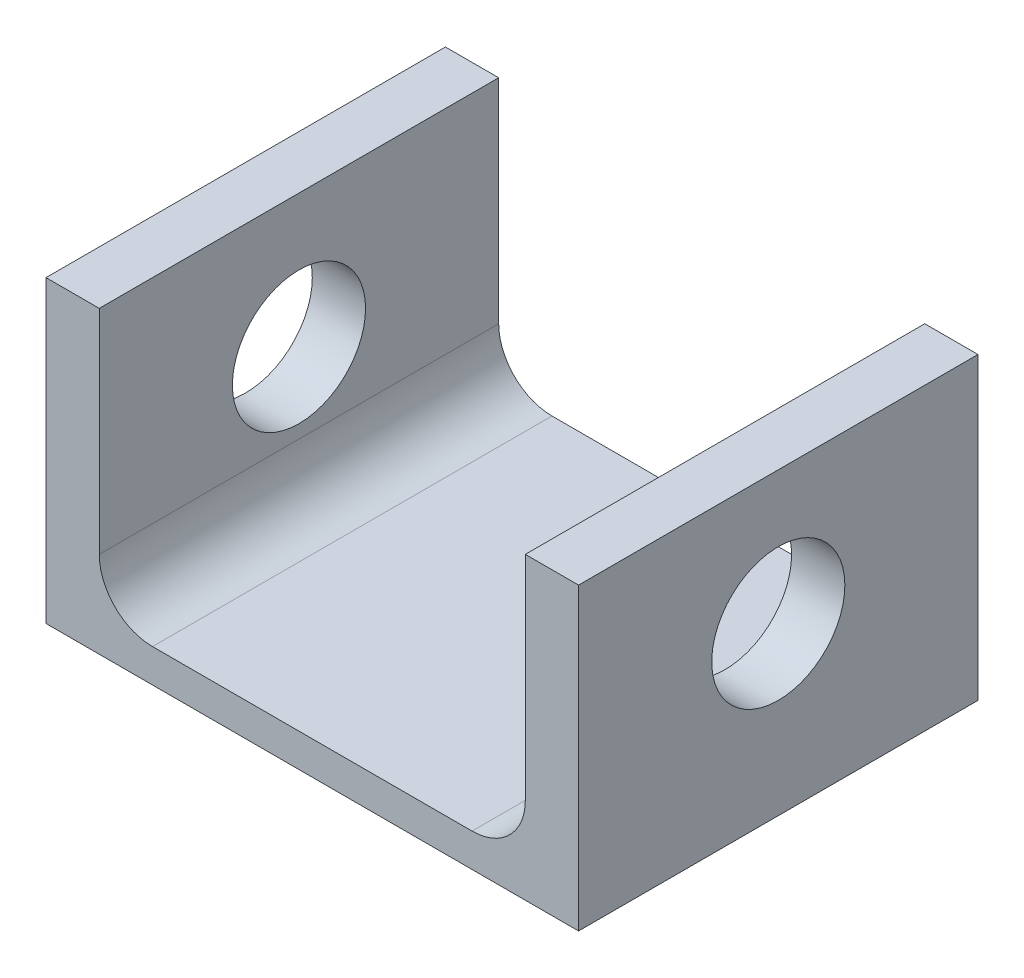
ISO-10303-21;
HEADER;
FILE_DESCRIPTION(('STEP AP214'),'2;1');
FILE_NAME('part.step','',(''),(''),'','','');
FILE_SCHEMA(('AUTOMOTIVE_DESIGN { 1 0 10303 214 1 1 1 1 }'));
ENDSEC;
DATA;
#1=APPLICATION_CONTEXT('core data for automotive mechanical design processes');
#2=APPLICATION_PROTOCOL_DEFINITION('international standard','automotive_design',2000,#1);
#3=PRODUCT_CONTEXT('',#1,'mechanical');
#4=PRODUCT('Part','Part','',(#3));
#5=PRODUCT_RELATED_PRODUCT_CATEGORY('part','',(#4));
#6=PRODUCT_DEFINITION_FORMATION('','',#4);
#7=PRODUCT_DEFINITION_CONTEXT('part definition',#1,'design');
#8=PRODUCT_DEFINITION('design','',#6,#7);
#9=PRODUCT_DEFINITION_SHAPE('','',#8);
#10=(LENGTH_UNIT() NAMED_UNIT(*) SI_UNIT(.MILLI.,.METRE.));
#11=(NAMED_UNIT(*) PLANE_ANGLE_UNIT() SI_UNIT($,.RADIAN.));
#12=(NAMED_UNIT(*) SI_UNIT($,.STERADIAN.) SOLID_ANGLE_UNIT());
#13=UNCERTAINTY_MEASURE_WITH_UNIT(LENGTH_MEASURE(1.E-05),#10,'distance_accuracy_value','');
#14=(GEOMETRIC_REPRESENTATION_CONTEXT(3) GLOBAL_UNCERTAINTY_ASSIGNED_CONTEXT((#13)) GLOBAL_UNIT_ASSIGNED_CONTEXT((#10,
#11,#12)) REPRESENTATION_CONTEXT('',''));
#15=CARTESIAN_POINT('',(0.,0.,0.));
#16=DIRECTION('',(0.,0.,1.));
#17=DIRECTION('',(1.,0.,0.));
#18=AXIS2_PLACEMENT_3D('',#15,#16,#17);
#19=CARTESIAN_POINT('',(-40.,45.,30.));
#20=DIRECTION('',(1.,0.,0.));
#21=DIRECTION('',(0.,0.,-1.));
#22=AXIS2_PLACEMENT_3D('',#19,#20,#21);
#23=PLANE('',#22);
#24=CARTESIAN_POINT('',(-40.,25.,0.));
#25=DIRECTION('',(1.,0.,0.));
#26=DIRECTION('',(0.,0.,-1.));
#27=AXIS2_PLACEMENT_3D('',#24,#25,#26);
#28=CIRCLE('',#27,10.);
#29=CARTESIAN_POINT('',(-40.,25.,-10.));
#30=VERTEX_POINT('',#29);
#31=EDGE_CURVE('E222',#30,#30,#28,.T.);
#32=ORIENTED_EDGE('',*,*,#31,.T.);
#33=EDGE_LOOP('',(#32));
#34=FACE_BOUND('',#33,.T.);
#35=DIRECTION('',(0.,-1.,0.));
#36=VECTOR('',#35,1.);
#37=CARTESIAN_POINT('',(-40.,45.,-30.));
#38=LINE('',#37,#36);
#39=CARTESIAN_POINT('',(-40.,45.,-30.));
#40=VERTEX_POINT('',#39);
#41=CARTESIAN_POINT('',(-40.,0.,-30.));
#42=VERTEX_POINT('',#41);
#43=EDGE_CURVE('E112',#40,#42,#38,.T.);
#44=ORIENTED_EDGE('',*,*,#43,.T.);
#45=DIRECTION('',(0.,0.,-1.));
#46=VECTOR('',#45,1.);
#47=CARTESIAN_POINT('',(-40.,0.,30.));
#48=LINE('',#47,#46);
#49=CARTESIAN_POINT('',(-40.,0.,30.));
#50=VERTEX_POINT('',#49);
#51=EDGE_CURVE('E11',#50,#42,#48,.T.);
#52=ORIENTED_EDGE('',*,*,#51,.F.);
#53=DIRECTION('',(0.,-1.,0.));
#54=VECTOR('',#53,1.);
#55=CARTESIAN_POINT('',(-40.,45.,30.));
#56=LINE('',#55,#54);
#57=CARTESIAN_POINT('',(-40.,45.,30.));
#58=VERTEX_POINT('',#57);
#59=EDGE_CURVE('E136',#58,#50,#56,.T.);
#60=ORIENTED_EDGE('',*,*,#59,.F.);
#61=DIRECTION('',(0.,0.,-1.));
#62=VECTOR('',#61,1.);
#63=CARTESIAN_POINT('',(-40.,45.,30.));
#64=LINE('',#63,#62);
#65=EDGE_CURVE('E125',#58,#40,#64,.T.);
#66=ORIENTED_EDGE('',*,*,#65,.T.);
#67=EDGE_LOOP('',(#44,#52,#60,#66));
#68=FACE_BOUND('',#67,.T.);
#69=ADVANCED_FACE('F30',(#34,#68),#23,.F.);
#70=CARTESIAN_POINT('',(-40.,0.,30.));
#71=DIRECTION('',(0.,1.,0.));
#72=DIRECTION('',(0.,0.,1.));
#73=AXIS2_PLACEMENT_3D('',#70,#71,#72);
#74=PLANE('',#73);
#75=DIRECTION('',(1.,0.,0.));
#76=VECTOR('',#75,1.);
#77=CARTESIAN_POINT('',(-40.,0.,-30.));
#78=LINE('',#77,#76);
#79=CARTESIAN_POINT('',(40.,0.,-30.));
#80=VERTEX_POINT('',#79);
#81=EDGE_CURVE('E108',#42,#80,#78,.T.);
#82=ORIENTED_EDGE('',*,*,#81,.T.);
#83=DIRECTION('',(0.,0.,-1.));
#84=VECTOR('',#83,1.);
#85=CARTESIAN_POINT('',(40.,0.,30.));
#86=LINE('',#85,#84);
#87=CARTESIAN_POINT('',(40.,0.,30.));
#88=VERTEX_POINT('',#87);
#89=EDGE_CURVE('E38',#88,#80,#86,.T.);
#90=ORIENTED_EDGE('',*,*,#89,.F.);
#91=DIRECTION('',(1.,0.,0.));
#92=VECTOR('',#91,1.);
#93=CARTESIAN_POINT('',(-40.,0.,30.));
#94=LINE('',#93,#92);
#95=EDGE_CURVE('E121',#50,#88,#94,.T.);
#96=ORIENTED_EDGE('',*,*,#95,.F.);
#97=ORIENTED_EDGE('',*,*,#51,.T.);
#98=EDGE_LOOP('',(#82,#90,#96,#97));
#99=FACE_BOUND('',#98,.T.);
#100=ADVANCED_FACE('F120',(#99),#74,.F.);
#101=CARTESIAN_POINT('',(40.,0.,30.));
#102=DIRECTION('',(-1.,0.,0.));
#103=DIRECTION('',(0.,0.,1.));
#104=AXIS2_PLACEMENT_3D('',#101,#102,#103);
#105=PLANE('',#104);
#106=CARTESIAN_POINT('',(40.,25.,0.));
#107=DIRECTION('',(1.,0.,0.));
#108=DIRECTION('',(0.,0.,-1.));
#109=AXIS2_PLACEMENT_3D('',#106,#107,#108);
#110=CIRCLE('',#109,10.);
#111=CARTESIAN_POINT('',(40.,25.,-10.));
#112=VERTEX_POINT('',#111);
#113=EDGE_CURVE('E219',#112,#112,#110,.T.);
#114=ORIENTED_EDGE('',*,*,#113,.F.);
#115=EDGE_LOOP('',(#114));
#116=FACE_BOUND('',#115,.T.);
#117=DIRECTION('',(0.,1.,0.));
#118=VECTOR('',#117,1.);
#119=CARTESIAN_POINT('',(40.,0.,-30.));
#120=LINE('',#119,#118);
#121=CARTESIAN_POINT('',(40.,45.,-30.));
#122=VERTEX_POINT('',#121);
#123=EDGE_CURVE('E114',#80,#122,#120,.T.);
#124=ORIENTED_EDGE('',*,*,#123,.T.);
#125=DIRECTION('',(0.,0.,-1.));
#126=VECTOR('',#125,1.);
#127=CARTESIAN_POINT('',(40.,45.,30.));
#128=LINE('',#127,#126);
#129=CARTESIAN_POINT('',(40.,45.,30.));
#130=VERTEX_POINT('',#129);
#131=EDGE_CURVE('E168',#130,#122,#128,.T.);
#132=ORIENTED_EDGE('',*,*,#131,.F.);
#133=DIRECTION('',(0.,1.,0.));
#134=VECTOR('',#133,1.);
#135=CARTESIAN_POINT('',(40.,0.,30.));
#136=LINE('',#135,#134);
#137=EDGE_CURVE('E135',#88,#130,#136,.T.);
#138=ORIENTED_EDGE('',*,*,#137,.F.);
#139=ORIENTED_EDGE('',*,*,#89,.T.);
#140=EDGE_LOOP('',(#124,#132,#138,#139));
#141=FACE_BOUND('',#140,.T.);
#142=ADVANCED_FACE('F173',(#116,#141),#105,.F.);
#143=CARTESIAN_POINT('',(40.,45.,30.));
#144=DIRECTION('',(0.,-1.,0.));
#145=DIRECTION('',(0.,0.,-1.));
#146=AXIS2_PLACEMENT_3D('',#143,#144,#145);
#147=PLANE('',#146);
#148=DIRECTION('',(-1.,0.,0.));
#149=VECTOR('',#148,1.);
#150=CARTESIAN_POINT('',(40.,45.,-30.));
#151=LINE('',#150,#149);
#152=CARTESIAN_POINT('',(32.,45.,-30.));
#153=VERTEX_POINT('',#152);
#154=EDGE_CURVE('E183',#122,#153,#151,.T.);
#155=ORIENTED_EDGE('',*,*,#154,.T.);
#156=DIRECTION('',(0.,0.,-1.));
#157=VECTOR('',#156,1.);
#158=CARTESIAN_POINT('',(32.,45.,30.));
#159=LINE('',#158,#157);
#160=CARTESIAN_POINT('',(32.,45.,30.));
#161=VERTEX_POINT('',#160);
#162=EDGE_CURVE('E165',#161,#153,#159,.T.);
#163=ORIENTED_EDGE('',*,*,#162,.F.);
#164=DIRECTION('',(-1.,0.,0.));
#165=VECTOR('',#164,1.);
#166=CARTESIAN_POINT('',(40.,45.,30.));
#167=LINE('',#166,#165);
#168=EDGE_CURVE('E138',#130,#161,#167,.T.);
#169=ORIENTED_EDGE('',*,*,#168,.F.);
#170=ORIENTED_EDGE('',*,*,#131,.T.);
#171=EDGE_LOOP('',(#155,#163,#169,#170));
#172=FACE_BOUND('',#171,.T.);
#173=ADVANCED_FACE('F182',(#172),#147,.F.);
#174=CARTESIAN_POINT('',(32.,45.,30.));
#175=DIRECTION('',(1.,0.,0.));
#176=DIRECTION('',(0.,0.,-1.));
#177=AXIS2_PLACEMENT_3D('',#174,#175,#176);
#178=PLANE('',#177);
#179=CARTESIAN_POINT('',(32.,25.,0.));
#180=DIRECTION('',(1.,0.,0.));
#181=DIRECTION('',(0.,0.,-1.));
#182=AXIS2_PLACEMENT_3D('',#179,#180,#181);
#183=CIRCLE('',#182,10.);
#184=CARTESIAN_POINT('',(32.,25.,-10.));
#185=VERTEX_POINT('',#184);
#186=EDGE_CURVE('E126',#185,#185,#183,.T.);
#187=ORIENTED_EDGE('',*,*,#186,.T.);
#188=EDGE_LOOP('',(#187));
#189=FACE_BOUND('',#188,.T.);
#190=DIRECTION('',(0.,-1.,0.));
#191=VECTOR('',#190,1.);
#192=CARTESIAN_POINT('',(32.,45.,-30.));
#193=LINE('',#192,#191);
#194=CARTESIAN_POINT('',(32.,13.,-30.));
#195=VERTEX_POINT('',#194);
#196=EDGE_CURVE('E188',#153,#195,#193,.T.);
#197=ORIENTED_EDGE('',*,*,#196,.T.);
#198=DIRECTION('',(0.,0.,-1.));
#199=VECTOR('',#198,1.);
#200=CARTESIAN_POINT('',(32.,13.,30.));
#201=LINE('',#200,#199);
#202=CARTESIAN_POINT('',(32.,13.,30.));
#203=VERTEX_POINT('',#202);
#204=EDGE_CURVE('E163',#203,#195,#201,.T.);
#205=ORIENTED_EDGE('',*,*,#204,.F.);
#206=DIRECTION('',(0.,-1.,0.));
#207=VECTOR('',#206,1.);
#208=CARTESIAN_POINT('',(32.,45.,30.));
#209=LINE('',#208,#207);
#210=EDGE_CURVE('E140',#161,#203,#209,.T.);
#211=ORIENTED_EDGE('',*,*,#210,.F.);
#212=ORIENTED_EDGE('',*,*,#162,.T.);
#213=EDGE_LOOP('',(#197,#205,#211,#212));
#214=FACE_BOUND('',#213,.T.);
#215=ADVANCED_FACE('F187',(#189,#214),#178,.F.);
#216=CARTESIAN_POINT('',(24.,13.,30.));
#217=DIRECTION('',(0.,0.,-1.));
#218=DIRECTION('',(-1.,0.,0.));
#219=AXIS2_PLACEMENT_3D('',#216,#217,#218);
#220=CYLINDRICAL_SURFACE('',#219,8.);
#221=CARTESIAN_POINT('',(24.,13.,-30.));
#222=DIRECTION('',(0.,0.,1.));
#223=DIRECTION('',(0.,1.,0.));
#224=AXIS2_PLACEMENT_3D('',#221,#222,#223);
#225=CIRCLE('',#224,8.);
#226=CARTESIAN_POINT('',(24.,5.,-30.));
#227=VERTEX_POINT('',#226);
#228=EDGE_CURVE('E214',#227,#195,#225,.T.);
#229=ORIENTED_EDGE('',*,*,#228,.F.);
#230=DIRECTION('',(0.,0.,-1.));
#231=VECTOR('',#230,1.);
#232=CARTESIAN_POINT('',(24.,5.,30.));
#233=LINE('',#232,#231);
#234=CARTESIAN_POINT('',(24.,5.,30.));
#235=VERTEX_POINT('',#234);
#236=EDGE_CURVE('E161',#235,#227,#233,.T.);
#237=ORIENTED_EDGE('',*,*,#236,.F.);
#238=CARTESIAN_POINT('',(24.,13.,30.));
#239=DIRECTION('',(0.,0.,1.));
#240=DIRECTION('',(0.,1.,0.));
#241=AXIS2_PLACEMENT_3D('',#238,#239,#240);
#242=CIRCLE('',#241,8.);
#243=EDGE_CURVE('E142',#235,#203,#242,.T.);
#244=ORIENTED_EDGE('',*,*,#243,.T.);
#245=ORIENTED_EDGE('',*,*,#204,.T.);
#246=EDGE_LOOP('',(#229,#237,#244,#245));
#247=FACE_BOUND('',#246,.T.);
#248=ADVANCED_FACE('F192',(#247),#220,.F.);
#249=CARTESIAN_POINT('',(24.,5.,30.));
#250=DIRECTION('',(0.,-1.,0.));
#251=DIRECTION('',(0.,0.,-1.));
#252=AXIS2_PLACEMENT_3D('',#249,#250,#251);
#253=PLANE('',#252);
#254=DIRECTION('',(-1.,0.,0.));
#255=VECTOR('',#254,1.);
#256=CARTESIAN_POINT('',(24.,5.,-30.));
#257=LINE('',#256,#255);
#258=CARTESIAN_POINT('',(-24.,5.,-30.));
#259=VERTEX_POINT('',#258);
#260=EDGE_CURVE('E199',#227,#259,#257,.T.);
#261=ORIENTED_EDGE('',*,*,#260,.T.);
#262=DIRECTION('',(0.,0.,-1.));
#263=VECTOR('',#262,1.);
#264=CARTESIAN_POINT('',(-24.,5.,30.));
#265=LINE('',#264,#263);
#266=CARTESIAN_POINT('',(-24.,5.,30.));
#267=VERTEX_POINT('',#266);
#268=EDGE_CURVE('E159',#267,#259,#265,.T.);
#269=ORIENTED_EDGE('',*,*,#268,.F.);
#270=DIRECTION('',(-1.,0.,0.));
#271=VECTOR('',#270,1.);
#272=CARTESIAN_POINT('',(24.,5.,30.));
#273=LINE('',#272,#271);
#274=EDGE_CURVE('E145',#235,#267,#273,.T.);
#275=ORIENTED_EDGE('',*,*,#274,.F.);
#276=ORIENTED_EDGE('',*,*,#236,.T.);
#277=EDGE_LOOP('',(#261,#269,#275,#276));
#278=FACE_BOUND('',#277,.T.);
#279=ADVANCED_FACE('F197',(#278),#253,.F.);
#280=CARTESIAN_POINT('',(-24.,13.,30.));
#281=DIRECTION('',(0.,0.,-1.));
#282=DIRECTION('',(-1.,0.,0.));
#283=AXIS2_PLACEMENT_3D('',#280,#281,#282);
#284=CYLINDRICAL_SURFACE('',#283,8.);
#285=CARTESIAN_POINT('',(-24.,13.,-30.));
#286=DIRECTION('',(0.,0.,1.));
#287=DIRECTION('',(0.,1.,0.));
#288=AXIS2_PLACEMENT_3D('',#285,#286,#287);
#289=CIRCLE('',#288,8.);
#290=CARTESIAN_POINT('',(-32.,13.,-30.));
#291=VERTEX_POINT('',#290);
#292=EDGE_CURVE('E204',#291,#259,#289,.T.);
#293=ORIENTED_EDGE('',*,*,#292,.F.);
#294=DIRECTION('',(0.,0.,-1.));
#295=VECTOR('',#294,1.);
#296=CARTESIAN_POINT('',(-32.,13.,30.));
#297=LINE('',#296,#295);
#298=CARTESIAN_POINT('',(-32.,13.,30.));
#299=VERTEX_POINT('',#298);
#300=EDGE_CURVE('E157',#299,#291,#297,.T.);
#301=ORIENTED_EDGE('',*,*,#300,.F.);
#302=CARTESIAN_POINT('',(-24.,13.,30.));
#303=DIRECTION('',(0.,0.,1.));
#304=DIRECTION('',(0.,1.,0.));
#305=AXIS2_PLACEMENT_3D('',#302,#303,#304);
#306=CIRCLE('',#305,8.);
#307=EDGE_CURVE('E147',#299,#267,#306,.T.);
#308=ORIENTED_EDGE('',*,*,#307,.T.);
#309=ORIENTED_EDGE('',*,*,#268,.T.);
#310=EDGE_LOOP('',(#293,#301,#308,#309));
#311=FACE_BOUND('',#310,.T.);
#312=ADVANCED_FACE('F203',(#311),#284,.F.);
#313=CARTESIAN_POINT('',(-32.,13.,30.));
#314=DIRECTION('',(-1.,0.,0.));
#315=DIRECTION('',(0.,0.,1.));
#316=AXIS2_PLACEMENT_3D('',#313,#314,#315);
#317=PLANE('',#316);
#318=CARTESIAN_POINT('',(-32.,25.,0.));
#319=DIRECTION('',(-1.,0.,0.));
#320=DIRECTION('',(0.,0.,1.));
#321=AXIS2_PLACEMENT_3D('',#318,#319,#320);
#322=CIRCLE('',#321,10.);
#323=CARTESIAN_POINT('',(-32.,25.,10.));
#324=VERTEX_POINT('',#323);
#325=EDGE_CURVE('E33',#324,#324,#322,.T.);
#326=ORIENTED_EDGE('',*,*,#325,.T.);
#327=EDGE_LOOP('',(#326));
#328=FACE_BOUND('',#327,.T.);
#329=DIRECTION('',(0.,1.,0.));
#330=VECTOR('',#329,1.);
#331=CARTESIAN_POINT('',(-32.,13.,-30.));
#332=LINE('',#331,#330);
#333=CARTESIAN_POINT('',(-32.,45.,-30.));
#334=VERTEX_POINT('',#333);
#335=EDGE_CURVE('E208',#291,#334,#332,.T.);
#336=ORIENTED_EDGE('',*,*,#335,.T.);
#337=DIRECTION('',(0.,0.,-1.));
#338=VECTOR('',#337,1.);
#339=CARTESIAN_POINT('',(-32.,45.,30.));
#340=LINE('',#339,#338);
#341=CARTESIAN_POINT('',(-32.,45.,30.));
#342=VERTEX_POINT('',#341);
#343=EDGE_CURVE('E154',#342,#334,#340,.T.);
#344=ORIENTED_EDGE('',*,*,#343,.F.);
#345=DIRECTION('',(0.,1.,0.));
#346=VECTOR('',#345,1.);
#347=CARTESIAN_POINT('',(-32.,13.,30.));
#348=LINE('',#347,#346);
#349=EDGE_CURVE('E50',#299,#342,#348,.T.);
#350=ORIENTED_EDGE('',*,*,#349,.F.);
#351=ORIENTED_EDGE('',*,*,#300,.T.);
#352=EDGE_LOOP('',(#336,#344,#350,#351));
#353=FACE_BOUND('',#352,.T.);
#354=ADVANCED_FACE('F207',(#328,#353),#317,.F.);
#355=CARTESIAN_POINT('',(-32.,45.,30.));
#356=DIRECTION('',(0.,-1.,0.));
#357=DIRECTION('',(0.,0.,-1.));
#358=AXIS2_PLACEMENT_3D('',#355,#356,#357);
#359=PLANE('',#358);
#360=DIRECTION('',(-1.,0.,0.));
#361=VECTOR('',#360,1.);
#362=CARTESIAN_POINT('',(-32.,45.,-30.));
#363=LINE('',#362,#361);
#364=EDGE_CURVE('E132',#334,#40,#363,.T.);
#365=ORIENTED_EDGE('',*,*,#364,.T.);
#366=ORIENTED_EDGE('',*,*,#65,.F.);
#367=DIRECTION('',(-1.,0.,0.));
#368=VECTOR('',#367,1.);
#369=CARTESIAN_POINT('',(-32.,45.,30.));
#370=LINE('',#369,#368);
#371=EDGE_CURVE('E45',#342,#58,#370,.T.);
#372=ORIENTED_EDGE('',*,*,#371,.F.);
#373=ORIENTED_EDGE('',*,*,#343,.T.);
#374=EDGE_LOOP('',(#365,#366,#372,#373));
#375=FACE_BOUND('',#374,.T.);
#376=ADVANCED_FACE('F210',(#375),#359,.F.);
#377=CARTESIAN_POINT('',(24.,13.,30.));
#378=DIRECTION('',(0.,0.,1.));
#379=DIRECTION('',(1.,0.,0.));
#380=AXIS2_PLACEMENT_3D('',#377,#378,#379);
#381=PLANE('',#380);
#382=ORIENTED_EDGE('',*,*,#59,.T.);
#383=ORIENTED_EDGE('',*,*,#95,.T.);
#384=ORIENTED_EDGE('',*,*,#137,.T.);
#385=ORIENTED_EDGE('',*,*,#168,.T.);
#386=ORIENTED_EDGE('',*,*,#210,.T.);
#387=ORIENTED_EDGE('',*,*,#243,.F.);
#388=ORIENTED_EDGE('',*,*,#274,.T.);
#389=ORIENTED_EDGE('',*,*,#307,.F.);
#390=ORIENTED_EDGE('',*,*,#349,.T.);
#391=ORIENTED_EDGE('',*,*,#371,.T.);
#392=EDGE_LOOP('',(#382,#383,#384,#385,#386,#387,#388,#389,#390,#391));
#393=FACE_BOUND('',#392,.T.);
#394=ADVANCED_FACE('F176',(#393),#381,.T.);
#395=CARTESIAN_POINT('',(24.,13.,-30.));
#396=DIRECTION('',(0.,0.,1.));
#397=DIRECTION('',(1.,0.,0.));
#398=AXIS2_PLACEMENT_3D('',#395,#396,#397);
#399=PLANE('',#398);
#400=ORIENTED_EDGE('',*,*,#43,.F.);
#401=ORIENTED_EDGE('',*,*,#364,.F.);
#402=ORIENTED_EDGE('',*,*,#335,.F.);
#403=ORIENTED_EDGE('',*,*,#292,.T.);
#404=ORIENTED_EDGE('',*,*,#260,.F.);
#405=ORIENTED_EDGE('',*,*,#228,.T.);
#406=ORIENTED_EDGE('',*,*,#196,.F.);
#407=ORIENTED_EDGE('',*,*,#154,.F.);
#408=ORIENTED_EDGE('',*,*,#123,.F.);
#409=ORIENTED_EDGE('',*,*,#81,.F.);
#410=EDGE_LOOP('',(#400,#401,#402,#403,#404,#405,#406,#407,#408,#409));
#411=FACE_BOUND('',#410,.T.);
#412=ADVANCED_FACE('F109',(#411),#399,.F.);
#413=CARTESIAN_POINT('',(-40.,25.,0.));
#414=DIRECTION('',(1.,0.,0.));
#415=DIRECTION('',(0.,0.,-1.));
#416=AXIS2_PLACEMENT_3D('',#413,#414,#415);
#417=CYLINDRICAL_SURFACE('',#416,10.);
#418=ORIENTED_EDGE('',*,*,#31,.F.);
#419=EDGE_LOOP('',(#418));
#420=FACE_BOUND('',#419,.T.);
#421=ORIENTED_EDGE('',*,*,#325,.F.);
#422=EDGE_LOOP('',(#421));
#423=FACE_BOUND('',#422,.T.);
#424=ADVANCED_FACE('F230',(#420,#423),#417,.F.);
#425=ORIENTED_EDGE('',*,*,#113,.T.);
#426=EDGE_LOOP('',(#425));
#427=FACE_BOUND('',#426,.T.);
#428=ORIENTED_EDGE('',*,*,#186,.F.);
#429=EDGE_LOOP('',(#428));
#430=FACE_BOUND('',#429,.T.);
#431=ADVANCED_FACE('F232',(#427,#430),#417,.F.);
#432=CLOSED_SHELL('',(#69,#100,#142,#173,#215,#248,#279,#312,#354,#376,#394,#412,#424,#431));
#433=MANIFOLD_SOLID_BREP('B2',#432);
#434=ADVANCED_BREP_SHAPE_REPRESENTATION('',(#18,#433),#14);
#435=SHAPE_DEFINITION_REPRESENTATION(#9,#434);
ENDSEC;
END-ISO-10303-21;
